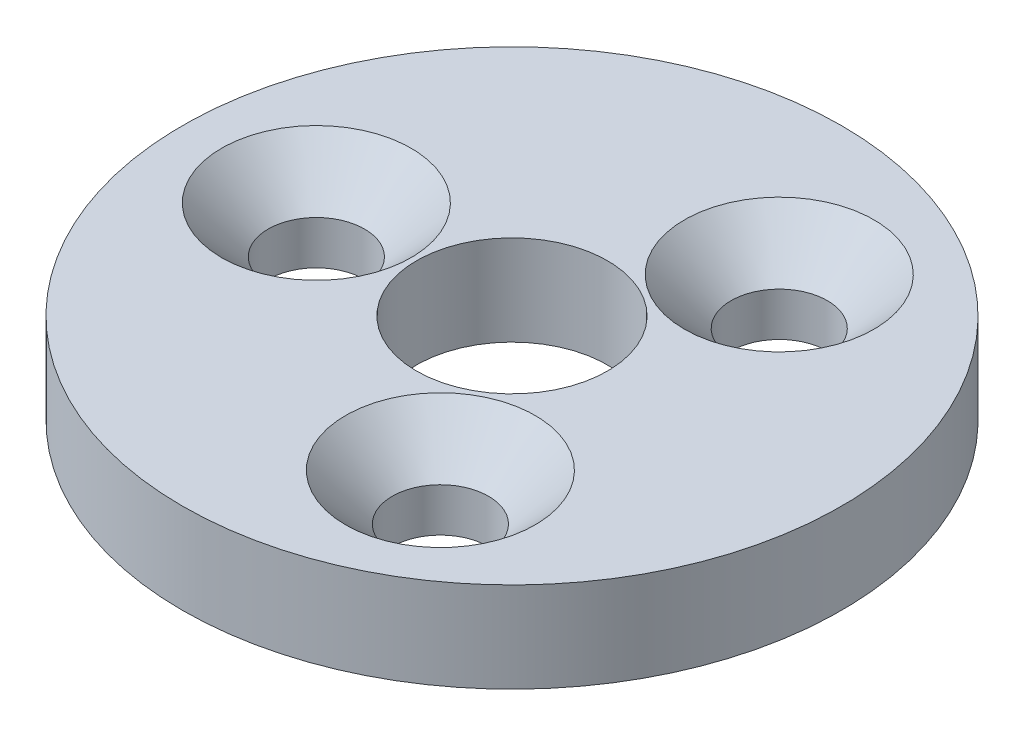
ISO-10303-21;
HEADER;
FILE_DESCRIPTION(('STEP AP214'),'2;1');
FILE_NAME('part.step','',(''),(''),'','','');
FILE_SCHEMA(('AUTOMOTIVE_DESIGN { 1 0 10303 214 1 1 1 1 }'));
ENDSEC;
DATA;
#1=APPLICATION_CONTEXT('core data for automotive mechanical design processes');
#2=APPLICATION_PROTOCOL_DEFINITION('international standard','automotive_design',2000,#1);
#3=PRODUCT_CONTEXT('',#1,'mechanical');
#4=PRODUCT('Part','Part','',(#3));
#5=PRODUCT_RELATED_PRODUCT_CATEGORY('part','',(#4));
#6=PRODUCT_DEFINITION_FORMATION('','',#4);
#7=PRODUCT_DEFINITION_CONTEXT('part definition',#1,'design');
#8=PRODUCT_DEFINITION('design','',#6,#7);
#9=PRODUCT_DEFINITION_SHAPE('','',#8);
#10=(LENGTH_UNIT() NAMED_UNIT(*) SI_UNIT(.MILLI.,.METRE.));
#11=(NAMED_UNIT(*) PLANE_ANGLE_UNIT() SI_UNIT($,.RADIAN.));
#12=(NAMED_UNIT(*) SI_UNIT($,.STERADIAN.) SOLID_ANGLE_UNIT());
#13=UNCERTAINTY_MEASURE_WITH_UNIT(LENGTH_MEASURE(1.E-05),#10,'distance_accuracy_value','');
#14=(GEOMETRIC_REPRESENTATION_CONTEXT(3) GLOBAL_UNCERTAINTY_ASSIGNED_CONTEXT((#13)) GLOBAL_UNIT_ASSIGNED_CONTEXT((#10,
#11,#12)) REPRESENTATION_CONTEXT('',''));
#15=CARTESIAN_POINT('',(0.,0.,0.));
#16=DIRECTION('',(0.,0.,1.));
#17=DIRECTION('',(1.,0.,0.));
#18=AXIS2_PLACEMENT_3D('',#15,#16,#17);
#19=CARTESIAN_POINT('',(0.,3.,0.));
#20=DIRECTION('',(0.,1.,0.));
#21=DIRECTION('',(0.,0.,1.));
#22=AXIS2_PLACEMENT_3D('',#19,#20,#21);
#23=PLANE('',#22);
#24=CARTESIAN_POINT('',(-6.5,3.,0.));
#25=DIRECTION('',(0.,1.,0.));
#26=DIRECTION('',(0.,0.,1.));
#27=AXIS2_PLACEMENT_3D('',#24,#25,#26);
#28=CIRCLE('',#27,3.15);
#29=CARTESIAN_POINT('',(-6.5,3.,3.15));
#30=VERTEX_POINT('',#29);
#31=EDGE_CURVE('E76',#30,#30,#28,.T.);
#32=ORIENTED_EDGE('',*,*,#31,.F.);
#33=EDGE_LOOP('',(#32));
#34=FACE_BOUND('',#33,.T.);
#35=CARTESIAN_POINT('',(3.25000000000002,3.,-5.62916512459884));
#36=DIRECTION('',(0.,1.,0.));
#37=DIRECTION('',(0.,0.,1.));
#38=AXIS2_PLACEMENT_3D('',#35,#36,#37);
#39=CIRCLE('',#38,3.15);
#40=CARTESIAN_POINT('',(3.25000000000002,3.,-2.47916512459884));
#41=VERTEX_POINT('',#40);
#42=EDGE_CURVE('E67',#41,#41,#39,.T.);
#43=ORIENTED_EDGE('',*,*,#42,.F.);
#44=EDGE_LOOP('',(#43));
#45=FACE_BOUND('',#44,.T.);
#46=CARTESIAN_POINT('',(3.24999999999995,3.,5.62916512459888));
#47=DIRECTION('',(0.,1.,0.));
#48=DIRECTION('',(0.,0.,1.));
#49=AXIS2_PLACEMENT_3D('',#46,#47,#48);
#50=CIRCLE('',#49,3.15);
#51=CARTESIAN_POINT('',(3.24999999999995,3.,8.77916512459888));
#52=VERTEX_POINT('',#51);
#53=EDGE_CURVE('E58',#52,#52,#50,.T.);
#54=ORIENTED_EDGE('',*,*,#53,.F.);
#55=EDGE_LOOP('',(#54));
#56=FACE_BOUND('',#55,.T.);
#57=CARTESIAN_POINT('',(0.,3.,0.));
#58=DIRECTION('',(0.,1.,0.));
#59=DIRECTION('',(0.,0.,1.));
#60=AXIS2_PLACEMENT_3D('',#57,#58,#59);
#61=CIRCLE('',#60,10.95);
#62=CARTESIAN_POINT('',(0.,3.,10.95));
#63=VERTEX_POINT('',#62);
#64=EDGE_CURVE('E10',#63,#63,#61,.T.);
#65=ORIENTED_EDGE('',*,*,#64,.T.);
#66=EDGE_LOOP('',(#65));
#67=FACE_BOUND('',#66,.T.);
#68=CARTESIAN_POINT('',(0.,3.,0.));
#69=DIRECTION('',(0.,1.,0.));
#70=DIRECTION('',(0.,0.,1.));
#71=AXIS2_PLACEMENT_3D('',#68,#69,#70);
#72=CIRCLE('',#71,3.175);
#73=CARTESIAN_POINT('',(0.,3.,3.175));
#74=VERTEX_POINT('',#73);
#75=EDGE_CURVE('E45',#74,#74,#72,.T.);
#76=ORIENTED_EDGE('',*,*,#75,.F.);
#77=EDGE_LOOP('',(#76));
#78=FACE_BOUND('',#77,.T.);
#79=ADVANCED_FACE('F34',(#34,#45,#56,#67,#78),#23,.T.);
#80=CARTESIAN_POINT('',(0.,0.,0.));
#81=DIRECTION('',(0.,1.,0.));
#82=DIRECTION('',(0.,0.,1.));
#83=AXIS2_PLACEMENT_3D('',#80,#81,#82);
#84=PLANE('',#83);
#85=CARTESIAN_POINT('',(-6.5,0.,0.));
#86=DIRECTION('',(0.,1.,0.));
#87=DIRECTION('',(0.,0.,1.));
#88=AXIS2_PLACEMENT_3D('',#85,#86,#87);
#89=CIRCLE('',#88,1.6);
#90=CARTESIAN_POINT('',(-6.5,0.,1.6));
#91=VERTEX_POINT('',#90);
#92=EDGE_CURVE('E70',#91,#91,#89,.T.);
#93=ORIENTED_EDGE('',*,*,#92,.T.);
#94=EDGE_LOOP('',(#93));
#95=FACE_BOUND('',#94,.T.);
#96=CARTESIAN_POINT('',(3.25000000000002,0.,-5.62916512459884));
#97=DIRECTION('',(0.,1.,0.));
#98=DIRECTION('',(0.,0.,1.));
#99=AXIS2_PLACEMENT_3D('',#96,#97,#98);
#100=CIRCLE('',#99,1.6);
#101=CARTESIAN_POINT('',(3.25000000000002,0.,-4.02916512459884));
#102=VERTEX_POINT('',#101);
#103=EDGE_CURVE('E61',#102,#102,#100,.T.);
#104=ORIENTED_EDGE('',*,*,#103,.T.);
#105=EDGE_LOOP('',(#104));
#106=FACE_BOUND('',#105,.T.);
#107=CARTESIAN_POINT('',(3.24999999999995,0.,5.62916512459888));
#108=DIRECTION('',(0.,1.,0.));
#109=DIRECTION('',(0.,0.,1.));
#110=AXIS2_PLACEMENT_3D('',#107,#108,#109);
#111=CIRCLE('',#110,1.6);
#112=CARTESIAN_POINT('',(3.24999999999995,0.,7.22916512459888));
#113=VERTEX_POINT('',#112);
#114=EDGE_CURVE('E50',#113,#113,#111,.T.);
#115=ORIENTED_EDGE('',*,*,#114,.T.);
#116=EDGE_LOOP('',(#115));
#117=FACE_BOUND('',#116,.T.);
#118=CARTESIAN_POINT('',(0.,0.,0.));
#119=DIRECTION('',(0.,1.,0.));
#120=DIRECTION('',(0.,0.,1.));
#121=AXIS2_PLACEMENT_3D('',#118,#119,#120);
#122=CIRCLE('',#121,10.95);
#123=CARTESIAN_POINT('',(0.,0.,10.95));
#124=VERTEX_POINT('',#123);
#125=EDGE_CURVE('E38',#124,#124,#122,.T.);
#126=ORIENTED_EDGE('',*,*,#125,.F.);
#127=EDGE_LOOP('',(#126));
#128=FACE_BOUND('',#127,.T.);
#129=CARTESIAN_POINT('',(0.,0.,0.));
#130=DIRECTION('',(0.,1.,0.));
#131=DIRECTION('',(0.,0.,1.));
#132=AXIS2_PLACEMENT_3D('',#129,#130,#131);
#133=CIRCLE('',#132,3.175);
#134=CARTESIAN_POINT('',(0.,0.,3.175));
#135=VERTEX_POINT('',#134);
#136=EDGE_CURVE('E47',#135,#135,#133,.T.);
#137=ORIENTED_EDGE('',*,*,#136,.T.);
#138=EDGE_LOOP('',(#137));
#139=FACE_BOUND('',#138,.T.);
#140=ADVANCED_FACE('F84',(#95,#106,#117,#128,#139),#84,.F.);
#141=CARTESIAN_POINT('',(0.,3.,0.));
#142=DIRECTION('',(0.,-1.,0.));
#143=DIRECTION('',(0.,0.,-1.));
#144=AXIS2_PLACEMENT_3D('',#141,#142,#143);
#145=CYLINDRICAL_SURFACE('',#144,10.95);
#146=ORIENTED_EDGE('',*,*,#64,.F.);
#147=EDGE_LOOP('',(#146));
#148=FACE_BOUND('',#147,.T.);
#149=ORIENTED_EDGE('',*,*,#125,.T.);
#150=EDGE_LOOP('',(#149));
#151=FACE_BOUND('',#150,.T.);
#152=ADVANCED_FACE('F36',(#148,#151),#145,.T.);
#153=CARTESIAN_POINT('',(0.,3.,0.));
#154=DIRECTION('',(0.,-1.,0.));
#155=DIRECTION('',(0.,0.,-1.));
#156=AXIS2_PLACEMENT_3D('',#153,#154,#155);
#157=CYLINDRICAL_SURFACE('',#156,3.175);
#158=ORIENTED_EDGE('',*,*,#75,.T.);
#159=EDGE_LOOP('',(#158));
#160=FACE_BOUND('',#159,.T.);
#161=ORIENTED_EDGE('',*,*,#136,.F.);
#162=EDGE_LOOP('',(#161));
#163=FACE_BOUND('',#162,.T.);
#164=ADVANCED_FACE('F92',(#160,#163),#157,.F.);
#165=CARTESIAN_POINT('',(3.24999999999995,3.,5.62916512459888));
#166=DIRECTION('',(0.,1.,0.));
#167=DIRECTION('',(0.,0.,1.));
#168=AXIS2_PLACEMENT_3D('',#165,#166,#167);
#169=CYLINDRICAL_SURFACE('',#168,1.6);
#170=ORIENTED_EDGE('',*,*,#114,.F.);
#171=EDGE_LOOP('',(#170));
#172=FACE_BOUND('',#171,.T.);
#173=CARTESIAN_POINT('',(3.24999999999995,1.45,5.62916512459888));
#174=DIRECTION('',(0.,1.,0.));
#175=DIRECTION('',(0.,0.,1.));
#176=AXIS2_PLACEMENT_3D('',#173,#174,#175);
#177=CIRCLE('',#176,1.6);
#178=CARTESIAN_POINT('',(3.24999999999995,1.45,7.22916512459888));
#179=VERTEX_POINT('',#178);
#180=EDGE_CURVE('E55',#179,#179,#177,.T.);
#181=ORIENTED_EDGE('',*,*,#180,.T.);
#182=EDGE_LOOP('',(#181));
#183=FACE_BOUND('',#182,.T.);
#184=ADVANCED_FACE('F95',(#172,#183),#169,.F.);
#185=CARTESIAN_POINT('',(3.24999999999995,3.,5.62916512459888));
#186=DIRECTION('',(0.,1.,0.));
#187=DIRECTION('',(0.,0.,1.));
#188=AXIS2_PLACEMENT_3D('',#185,#186,#187);
#189=CONICAL_SURFACE('',#188,3.15,0.785398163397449);
#190=ORIENTED_EDGE('',*,*,#180,.F.);
#191=EDGE_LOOP('',(#190));
#192=FACE_BOUND('',#191,.T.);
#193=ORIENTED_EDGE('',*,*,#53,.T.);
#194=EDGE_LOOP('',(#193));
#195=FACE_BOUND('',#194,.T.);
#196=ADVANCED_FACE('F109',(#192,#195),#189,.F.);
#197=CARTESIAN_POINT('',(3.25000000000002,3.,-5.62916512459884));
#198=DIRECTION('',(0.,1.,0.));
#199=DIRECTION('',(0.,0.,1.));
#200=AXIS2_PLACEMENT_3D('',#197,#198,#199);
#201=CYLINDRICAL_SURFACE('',#200,1.6);
#202=ORIENTED_EDGE('',*,*,#103,.F.);
#203=EDGE_LOOP('',(#202));
#204=FACE_BOUND('',#203,.T.);
#205=CARTESIAN_POINT('',(3.25000000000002,1.45,-5.62916512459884));
#206=DIRECTION('',(0.,1.,0.));
#207=DIRECTION('',(0.,0.,1.));
#208=AXIS2_PLACEMENT_3D('',#205,#206,#207);
#209=CIRCLE('',#208,1.6);
#210=CARTESIAN_POINT('',(3.25000000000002,1.45,-4.02916512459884));
#211=VERTEX_POINT('',#210);
#212=EDGE_CURVE('E64',#211,#211,#209,.T.);
#213=ORIENTED_EDGE('',*,*,#212,.T.);
#214=EDGE_LOOP('',(#213));
#215=FACE_BOUND('',#214,.T.);
#216=ADVANCED_FACE('F113',(#204,#215),#201,.F.);
#217=CARTESIAN_POINT('',(3.25000000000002,3.,-5.62916512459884));
#218=DIRECTION('',(0.,1.,0.));
#219=DIRECTION('',(0.,0.,1.));
#220=AXIS2_PLACEMENT_3D('',#217,#218,#219);
#221=CONICAL_SURFACE('',#220,3.15,0.785398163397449);
#222=ORIENTED_EDGE('',*,*,#212,.F.);
#223=EDGE_LOOP('',(#222));
#224=FACE_BOUND('',#223,.T.);
#225=ORIENTED_EDGE('',*,*,#42,.T.);
#226=EDGE_LOOP('',(#225));
#227=FACE_BOUND('',#226,.T.);
#228=ADVANCED_FACE('F117',(#224,#227),#221,.F.);
#229=CARTESIAN_POINT('',(-6.5,3.,0.));
#230=DIRECTION('',(0.,1.,0.));
#231=DIRECTION('',(0.,0.,1.));
#232=AXIS2_PLACEMENT_3D('',#229,#230,#231);
#233=CYLINDRICAL_SURFACE('',#232,1.6);
#234=ORIENTED_EDGE('',*,*,#92,.F.);
#235=EDGE_LOOP('',(#234));
#236=FACE_BOUND('',#235,.T.);
#237=CARTESIAN_POINT('',(-6.5,1.45,0.));
#238=DIRECTION('',(0.,1.,0.));
#239=DIRECTION('',(0.,0.,1.));
#240=AXIS2_PLACEMENT_3D('',#237,#238,#239);
#241=CIRCLE('',#240,1.6);
#242=CARTESIAN_POINT('',(-6.5,1.45,1.6));
#243=VERTEX_POINT('',#242);
#244=EDGE_CURVE('E73',#243,#243,#241,.T.);
#245=ORIENTED_EDGE('',*,*,#244,.T.);
#246=EDGE_LOOP('',(#245));
#247=FACE_BOUND('',#246,.T.);
#248=ADVANCED_FACE('F121',(#236,#247),#233,.F.);
#249=CARTESIAN_POINT('',(-6.5,3.,0.));
#250=DIRECTION('',(0.,1.,0.));
#251=DIRECTION('',(0.,0.,1.));
#252=AXIS2_PLACEMENT_3D('',#249,#250,#251);
#253=CONICAL_SURFACE('',#252,3.15,0.785398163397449);
#254=ORIENTED_EDGE('',*,*,#244,.F.);
#255=EDGE_LOOP('',(#254));
#256=FACE_BOUND('',#255,.T.);
#257=ORIENTED_EDGE('',*,*,#31,.T.);
#258=EDGE_LOOP('',(#257));
#259=FACE_BOUND('',#258,.T.);
#260=ADVANCED_FACE('F80',(#256,#259),#253,.F.);
#261=CLOSED_SHELL('',(#79,#140,#152,#164,#184,#196,#216,#228,#248,#260));
#262=MANIFOLD_SOLID_BREP('B2',#261);
#263=ADVANCED_BREP_SHAPE_REPRESENTATION('',(#18,#262),#14);
#264=SHAPE_DEFINITION_REPRESENTATION(#9,#263);
ENDSEC;
END-ISO-10303-21;
